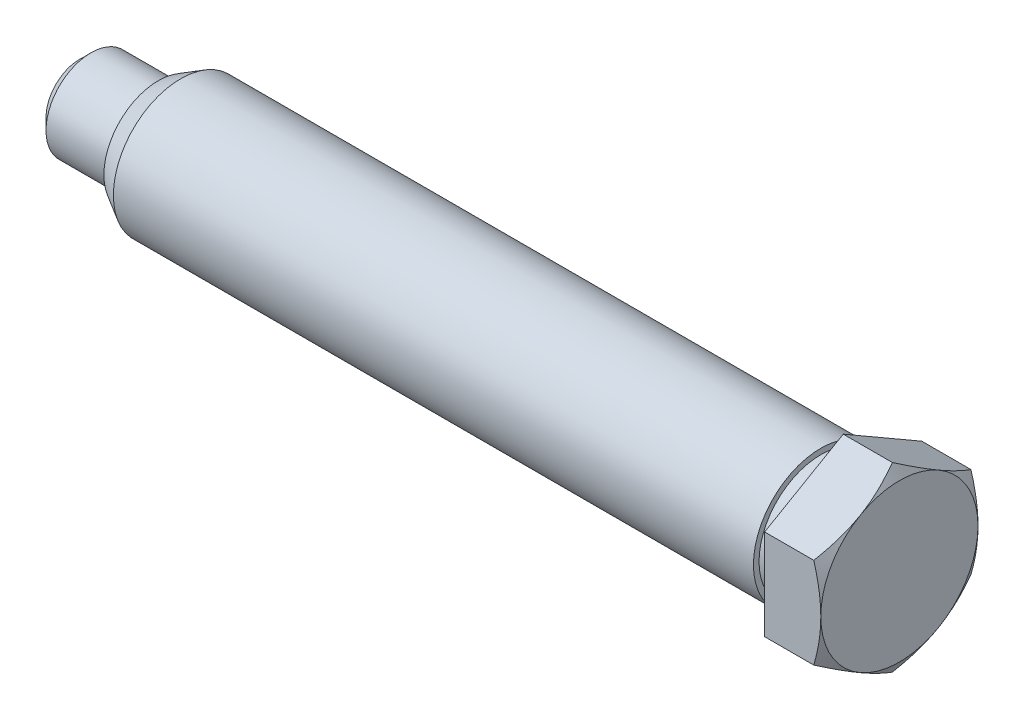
ISO-10303-21;
HEADER;
FILE_DESCRIPTION(('STEP AP214'),'2;1');
FILE_NAME('part.step','',(''),(''),'','','');
FILE_SCHEMA(('AUTOMOTIVE_DESIGN { 1 0 10303 214 1 1 1 1 }'));
ENDSEC;
DATA;
#1=APPLICATION_CONTEXT('core data for automotive mechanical design processes');
#2=APPLICATION_PROTOCOL_DEFINITION('international standard','automotive_design',2000,#1);
#3=PRODUCT_CONTEXT('',#1,'mechanical');
#4=PRODUCT('Part','Part','',(#3));
#5=PRODUCT_RELATED_PRODUCT_CATEGORY('part','',(#4));
#6=PRODUCT_DEFINITION_FORMATION('','',#4);
#7=PRODUCT_DEFINITION_CONTEXT('part definition',#1,'design');
#8=PRODUCT_DEFINITION('design','',#6,#7);
#9=PRODUCT_DEFINITION_SHAPE('','',#8);
#10=(LENGTH_UNIT() NAMED_UNIT(*) SI_UNIT(.MILLI.,.METRE.));
#11=(NAMED_UNIT(*) PLANE_ANGLE_UNIT() SI_UNIT($,.RADIAN.));
#12=(NAMED_UNIT(*) SI_UNIT($,.STERADIAN.) SOLID_ANGLE_UNIT());
#13=UNCERTAINTY_MEASURE_WITH_UNIT(LENGTH_MEASURE(1.E-05),#10,'distance_accuracy_value','');
#14=(GEOMETRIC_REPRESENTATION_CONTEXT(3) GLOBAL_UNCERTAINTY_ASSIGNED_CONTEXT((#13)) GLOBAL_UNIT_ASSIGNED_CONTEXT((#10,
#11,#12)) REPRESENTATION_CONTEXT('',''));
#15=CARTESIAN_POINT('',(0.,0.,0.));
#16=DIRECTION('',(0.,0.,1.));
#17=DIRECTION('',(1.,0.,0.));
#18=AXIS2_PLACEMENT_3D('',#15,#16,#17);
#19=CARTESIAN_POINT('',(-7.00000000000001,0.,0.));
#20=DIRECTION('',(-1.,0.,0.));
#21=DIRECTION('',(0.,0.,1.));
#22=AXIS2_PLACEMENT_3D('',#19,#20,#21);
#23=CONICAL_SURFACE('',#22,7.,1.04719755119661);
#24=CARTESIAN_POINT('',(-7.6252814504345,-4.04133641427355,-7.0002));
#25=CARTESIAN_POINT('',(-7.57399984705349,-4.13017208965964,-6.84633209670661));
#26=CARTESIAN_POINT('',(-7.52504559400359,-4.21933898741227,-6.69189049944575));
#27=CARTESIAN_POINT('',(-7.43243278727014,-4.3983969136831,-6.38175307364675));
#28=CARTESIAN_POINT('',(-7.38877651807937,-4.48828823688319,-6.22605673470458));
#29=CARTESIAN_POINT('',(-7.2666115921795,-4.7594014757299,-5.75647483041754));
#30=CARTESIAN_POINT('',(-7.19712555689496,-4.94169356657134,-5.4407356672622));
#31=CARTESIAN_POINT('',(-7.1156449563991,-5.21449036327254,-4.96823775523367));
#32=CARTESIAN_POINT('',(-7.09243348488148,-5.30417998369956,-4.81289077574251));
#33=CARTESIAN_POINT('',(-7.05351121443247,-5.48396448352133,-4.50149488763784));
#34=CARTESIAN_POINT('',(-7.03779975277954,-5.57405932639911,-4.34544604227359));
#35=CARTESIAN_POINT('',(-7.01427791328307,-5.75440548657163,-4.03307732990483));
#36=CARTESIAN_POINT('',(-7.00645856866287,-5.84465650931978,-3.87675797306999));
#37=CARTESIAN_POINT('',(-6.99888024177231,-6.02523694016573,-3.56398349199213));
#38=CARTESIAN_POINT('',(-6.99912101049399,-6.11556634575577,-3.40752837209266));
#39=CARTESIAN_POINT('',(-7.01085973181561,-6.36303901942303,-2.97889312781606));
#40=CARTESIAN_POINT('',(-7.03056574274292,-6.52010127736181,-2.7068533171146));
#41=CARTESIAN_POINT('',(-7.09305346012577,-6.83318259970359,-2.1645805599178));
#42=CARTESIAN_POINT('',(-7.13585652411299,-6.9892005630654,-1.89434952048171));
#43=CARTESIAN_POINT('',(-7.24285167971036,-7.30291195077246,-1.35098545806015));
#44=CARTESIAN_POINT('',(-7.30749709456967,-7.46056579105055,-1.07792099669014));
#45=CARTESIAN_POINT('',(-7.45421607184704,-7.77352241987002,-0.535864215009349));
#46=CARTESIAN_POINT('',(-7.53625517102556,-7.92882921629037,-0.266864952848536));
#47=CARTESIAN_POINT('',(-7.6252814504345,-8.08301923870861,0.000200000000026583));
#48=B_SPLINE_CURVE_WITH_KNOTS('',3,(#24,#25,#26,#27,#28,#29,#30,#31,#32,#33,#34,#35,#36,#37,#38,
#39,#40,#41,#42,#43,#44,#45,#46,#47),.UNSPECIFIED.,.F.,.F.,(4,2,2,2,2,2,2,2,2,2,2,4),(0.,
0.554727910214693,1.10969417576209,2.22193274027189,2.76443041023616,3.30688013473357,
3.84871284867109,4.39052882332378,5.33376515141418,6.27787517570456,7.24292418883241,
8.20607866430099),.UNSPECIFIED.);
#49=CARTESIAN_POINT('',(-7.62521478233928,-4.04145188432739,-7.));
#50=VERTEX_POINT('',#49);
#51=CARTESIAN_POINT('',(-7.,-6.06217782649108,-3.49999999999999));
#52=VERTEX_POINT('',#51);
#53=EDGE_CURVE('E189',#50,#52,#48,.T.);
#54=ORIENTED_EDGE('',*,*,#53,.F.);
#55=CARTESIAN_POINT('',(-12.0562612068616,-14.1175476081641,-7.));
#56=CARTESIAN_POINT('',(-11.878791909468,-13.7743985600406,-7.));
#57=CARTESIAN_POINT('',(-11.7022877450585,-13.4307456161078,-7.));
#58=CARTESIAN_POINT('',(-11.3517233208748,-12.7421707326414,-7.));
#59=CARTESIAN_POINT('',(-11.1776632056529,-12.397248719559,-7.));
#60=CARTESIAN_POINT('',(-10.8321439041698,-11.705158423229,-7.));
#61=CARTESIAN_POINT('',(-10.6606912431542,-11.3579868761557,-7.));
#62=CARTESIAN_POINT('',(-10.3215136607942,-10.6618336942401,-7.));
#63=CARTESIAN_POINT('',(-10.1537886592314,-10.3128520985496,-7.));
#64=CARTESIAN_POINT('',(-9.81363419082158,-9.59280463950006,-7.));
#65=CARTESIAN_POINT('',(-9.6414778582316,-9.22160934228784,-7.));
#66=CARTESIAN_POINT('',(-9.30391684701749,-8.47612168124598,-7.));
#67=CARTESIAN_POINT('',(-9.13851258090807,-8.10182912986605,-7.));
#68=CARTESIAN_POINT('',(-8.81672448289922,-7.34972432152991,-7.));
#69=CARTESIAN_POINT('',(-8.66033342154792,-6.97191517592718,-7.));
#70=CARTESIAN_POINT('',(-8.35940411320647,-6.21163259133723,-7.));
#71=CARTESIAN_POINT('',(-8.21486407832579,-5.8291598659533,-7.));
#72=CARTESIAN_POINT('',(-7.94328979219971,-5.06293805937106,-7.));
#73=CARTESIAN_POINT('',(-7.81607293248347,-4.6792545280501,-7.));
#74=CARTESIAN_POINT('',(-7.58253882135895,-3.90546502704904,-7.));
#75=CARTESIAN_POINT('',(-7.47622242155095,-3.51535879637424,-7.));
#76=CARTESIAN_POINT('',(-7.29304744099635,-2.73628130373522,-7.));
#77=CARTESIAN_POINT('',(-7.21564346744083,-2.34744267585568,-7.));
#78=CARTESIAN_POINT('',(-7.12441210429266,-1.76036363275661,-7.));
#79=CARTESIAN_POINT('',(-7.09814702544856,-1.56402816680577,-7.));
#80=CARTESIAN_POINT('',(-7.05458221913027,-1.17037366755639,-7.));
#81=CARTESIAN_POINT('',(-7.03728155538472,-0.973054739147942,-7.));
#82=CARTESIAN_POINT('',(-7.00927366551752,-0.532376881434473,-7.));
#83=CARTESIAN_POINT('',(-7.00099536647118,-0.288858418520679,-7.));
#84=CARTESIAN_POINT('',(-6.99917395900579,0.198238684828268,-7.));
#85=CARTESIAN_POINT('',(-7.00563138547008,0.441817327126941,-7.));
#86=CARTESIAN_POINT('',(-7.03297849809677,0.928201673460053,-7.));
#87=CARTESIAN_POINT('',(-7.05387107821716,1.17100721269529,-7.));
#88=CARTESIAN_POINT('',(-7.1091669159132,1.65506190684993,-7.));
#89=CARTESIAN_POINT('',(-7.14357063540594,1.89631100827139,-7.));
#90=CARTESIAN_POINT('',(-7.2256876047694,2.38354553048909,-7.));
#91=CARTESIAN_POINT('',(-7.27375043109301,2.62947140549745,-7.));
#92=CARTESIAN_POINT('',(-7.38106474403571,3.11884982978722,-7.));
#93=CARTESIAN_POINT('',(-7.44031652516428,3.3623023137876,-7.));
#94=CARTESIAN_POINT('',(-7.56837219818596,3.84680041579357,-7.));
#95=CARTESIAN_POINT('',(-7.63718116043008,4.08784468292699,-7.));
#96=CARTESIAN_POINT('',(-7.7828001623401,4.56747016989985,-7.));
#97=CARTESIAN_POINT('',(-7.8596097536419,4.80605152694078,-7.));
#98=CARTESIAN_POINT('',(-8.08438383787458,5.47209968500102,-7.));
#99=CARTESIAN_POINT('',(-8.23985795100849,5.89702916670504,-7.));
#100=CARTESIAN_POINT('',(-8.56634029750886,6.74091481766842,-7.));
#101=CARTESIAN_POINT('',(-8.73735291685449,7.159869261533,-7.));
#102=CARTESIAN_POINT('',(-9.0908103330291,7.99336644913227,-7.));
#103=CARTESIAN_POINT('',(-9.273265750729,8.40790466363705,-7.));
#104=CARTESIAN_POINT('',(-9.64648191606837,9.23315066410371,-7.));
#105=CARTESIAN_POINT('',(-9.83724178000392,9.64385885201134,-7.));
#106=CARTESIAN_POINT('',(-10.2256412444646,10.4635987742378,-7.));
#107=CARTESIAN_POINT('',(-10.4233007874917,10.8726210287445,-7.));
#108=CARTESIAN_POINT('',(-10.8234523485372,11.6882996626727,-7.));
#109=CARTESIAN_POINT('',(-11.0259444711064,12.0949559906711,-7.));
#110=CARTESIAN_POINT('',(-11.4345832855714,12.906151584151,-7.));
#111=CARTESIAN_POINT('',(-11.6407279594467,13.3106918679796,-7.));
#112=CARTESIAN_POINT('',(-12.0559997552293,14.1182324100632,-7.));
#113=CARTESIAN_POINT('',(-12.2651268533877,14.5212326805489,-7.));
#114=CARTESIAN_POINT('',(-12.8393126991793,15.619741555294,-7.));
#115=CARTESIAN_POINT('',(-13.2067496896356,16.3140064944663,-7.));
#116=CARTESIAN_POINT('',(-13.9467083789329,17.6999493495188,-7.));
#117=CARTESIAN_POINT('',(-14.3192308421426,18.391626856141,-7.));
#118=CARTESIAN_POINT('',(-15.0655016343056,19.7684289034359,-7.));
#119=CARTESIAN_POINT('',(-15.4392257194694,20.4535665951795,-7.));
#120=CARTESIAN_POINT('',(-16.0018406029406,21.4800820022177,-7.));
#121=CARTESIAN_POINT('',(-16.189700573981,21.8220255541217,-7.));
#122=CARTESIAN_POINT('',(-16.5660272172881,22.5055779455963,-7.));
#123=CARTESIAN_POINT('',(-16.7544938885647,22.8471867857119,-7.));
#124=CARTESIAN_POINT('',(-16.9432241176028,23.1886499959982,-7.));
#125=B_SPLINE_CURVE_WITH_KNOTS('',3,(#55,#56,#57,#58,#59,#60,#61,#62,#63,#64,#65,#66,#67,#68,
#69,#70,#71,#72,#73,#74,#75,#76,#77,#78,#79,#80,#81,#82,#83,#84,#85,#86,#87,#88,#89,#90,#91,#92,
#93,#94,#95,#96,#97,#98,#99,#100,#101,#102,#103,#104,#105,#106,#107,#108,#109,#110,#111,#112,
#113,#114,#115,#116,#117,#118,#119,#120,#121,#122,#123,#124),.UNSPECIFIED.,.F.,.F.,(4,2,2,2,2,2,
2,2,2,2,2,2,2,2,2,2,2,2,2,2,2,2,2,2,2,2,2,2,2,2,2,2,2,2,4),(0.,1.15897826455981,2.3180247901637,
3.4796076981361,4.64116558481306,5.86863732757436,7.09618395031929,8.32273185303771,
9.5490943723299,10.7613184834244,11.9735919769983,13.1616794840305,13.7557568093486,
14.3497720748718,15.0802978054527,15.8108500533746,16.5415488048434,17.2722725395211,
18.0237060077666,18.7751592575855,19.5270127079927,20.2788240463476,21.6357796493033,
22.9931194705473,24.3517383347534,25.7102129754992,27.073006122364,28.4358287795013,
29.7979206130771,31.1600016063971,33.5164749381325,35.8733064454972,38.2146112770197,
39.3850598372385,40.5555064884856),.UNSPECIFIED.);
#126=CARTESIAN_POINT('',(-7.,0.,-7.));
#127=VERTEX_POINT('',#126);
#128=EDGE_CURVE('E180',#127,#50,#125,.F.);
#129=ORIENTED_EDGE('',*,*,#128,.F.);
#130=CARTESIAN_POINT('',(-7.00000000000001,0.,0.));
#131=DIRECTION('',(-1.,0.,0.));
#132=DIRECTION('',(0.,0.,1.));
#133=AXIS2_PLACEMENT_3D('',#130,#131,#132);
#134=CIRCLE('',#133,7.);
#135=EDGE_CURVE('E134',#127,#52,#134,.T.);
#136=ORIENTED_EDGE('',*,*,#135,.T.);
#137=EDGE_LOOP('',(#54,#129,#136));
#138=FACE_BOUND('',#137,.T.);
#139=ADVANCED_FACE('F34',(#138),#23,.T.);
#140=CARTESIAN_POINT('',(-7.62521478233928,-8.08290376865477,0.));
#141=VERTEX_POINT('',#140);
#142=EDGE_CURVE('E133',#52,#141,#48,.T.);
#143=ORIENTED_EDGE('',*,*,#142,.F.);
#144=CARTESIAN_POINT('',(-7.,-6.06217782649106,3.50000000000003));
#145=VERTEX_POINT('',#144);
#146=EDGE_CURVE('E125',#52,#145,#134,.T.);
#147=ORIENTED_EDGE('',*,*,#146,.T.);
#148=CARTESIAN_POINT('',(-7.6252814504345,-8.08301923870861,-0.000199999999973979));
#149=CARTESIAN_POINT('',(-7.57399984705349,-7.99418356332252,0.153667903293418));
#150=CARTESIAN_POINT('',(-7.52504559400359,-7.90501666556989,0.308109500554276));
#151=CARTESIAN_POINT('',(-7.43243278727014,-7.72595873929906,0.618246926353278));
#152=CARTESIAN_POINT('',(-7.38877651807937,-7.63606741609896,0.773943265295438));
#153=CARTESIAN_POINT('',(-7.2666115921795,-7.36495417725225,1.24352516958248));
#154=CARTESIAN_POINT('',(-7.19712555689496,-7.18266208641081,1.55926433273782));
#155=CARTESIAN_POINT('',(-7.1156449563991,-6.9098652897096,2.03176224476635));
#156=CARTESIAN_POINT('',(-7.09243348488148,-6.82017566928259,2.1871092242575));
#157=CARTESIAN_POINT('',(-7.05351121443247,-6.64039116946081,2.49850511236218));
#158=CARTESIAN_POINT('',(-7.03779975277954,-6.55029632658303,2.65455395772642));
#159=CARTESIAN_POINT('',(-7.01427791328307,-6.36995016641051,2.96692267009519));
#160=CARTESIAN_POINT('',(-7.00645856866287,-6.27969914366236,3.12324202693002));
#161=CARTESIAN_POINT('',(-6.99888024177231,-6.09911871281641,3.43601650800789));
#162=CARTESIAN_POINT('',(-6.99912101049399,-6.00878930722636,3.59247162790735));
#163=CARTESIAN_POINT('',(-7.01085973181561,-5.7613166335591,4.02110687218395));
#164=CARTESIAN_POINT('',(-7.03056574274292,-5.60425437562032,4.29314668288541));
#165=CARTESIAN_POINT('',(-7.09305346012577,-5.29117305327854,4.8354194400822));
#166=CARTESIAN_POINT('',(-7.13585652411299,-5.13515508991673,5.10565047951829));
#167=CARTESIAN_POINT('',(-7.24285167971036,-4.82144370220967,5.64901454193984));
#168=CARTESIAN_POINT('',(-7.30749709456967,-4.66378986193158,5.92207900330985));
#169=CARTESIAN_POINT('',(-7.45421607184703,-4.35083323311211,6.46413578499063));
#170=CARTESIAN_POINT('',(-7.53625517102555,-4.19552643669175,6.73313504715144));
#171=CARTESIAN_POINT('',(-7.62528145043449,-4.04133641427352,7.0002));
#172=B_SPLINE_CURVE_WITH_KNOTS('',3,(#148,#149,#150,#151,#152,#153,#154,#155,#156,#157,#158,
#159,#160,#161,#162,#163,#164,#165,#166,#167,#168,#169,#170,#171),.UNSPECIFIED.,.F.,.F.,(4,2,2,
2,2,2,2,2,2,2,2,4),(0.,0.554727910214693,1.10969417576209,2.22193274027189,2.76443041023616,
3.30688013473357,3.84871284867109,4.39052882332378,5.33376515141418,6.27787517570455,
7.24292418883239,8.20607866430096),.UNSPECIFIED.);
#173=EDGE_CURVE('E105',#141,#145,#172,.T.);
#174=ORIENTED_EDGE('',*,*,#173,.F.);
#175=EDGE_LOOP('',(#143,#147,#174));
#176=FACE_BOUND('',#175,.T.);
#177=ADVANCED_FACE('F132',(#176),#23,.T.);
#178=CARTESIAN_POINT('',(-7.62521478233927,-4.04145188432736,7.));
#179=VERTEX_POINT('',#178);
#180=EDGE_CURVE('E57',#145,#179,#172,.T.);
#181=ORIENTED_EDGE('',*,*,#180,.F.);
#182=CARTESIAN_POINT('',(-7.,0.,7.));
#183=VERTEX_POINT('',#182);
#184=EDGE_CURVE('E117',#145,#183,#134,.T.);
#185=ORIENTED_EDGE('',*,*,#184,.T.);
#186=CARTESIAN_POINT('',(-12.0562612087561,-14.1175476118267,7.));
#187=CARTESIAN_POINT('',(-11.878791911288,-13.7743985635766,7.));
#188=CARTESIAN_POINT('',(-11.7022877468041,-13.4307456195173,7.));
#189=CARTESIAN_POINT('',(-11.3517233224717,-12.7421707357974,7.));
#190=CARTESIAN_POINT('',(-11.1776632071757,-12.3972487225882,7.));
#191=CARTESIAN_POINT('',(-10.8321439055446,-11.7051584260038,7.));
#192=CARTESIAN_POINT('',(-10.660691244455,-11.3579868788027,7.));
#193=CARTESIAN_POINT('',(-10.3215136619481,-10.6618336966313,7.));
#194=CARTESIAN_POINT('',(-10.1537886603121,-10.3128521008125,7.));
#195=CARTESIAN_POINT('',(-9.81363419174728,-9.59280464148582,7.));
#196=CARTESIAN_POINT('',(-9.64147785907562,-9.22160934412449,7.));
#197=CARTESIAN_POINT('',(-9.30391684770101,-8.47612168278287,7.));
#198=CARTESIAN_POINT('',(-9.13851258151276,-8.10182913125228,7.));
#199=CARTESIAN_POINT('',(-8.81672448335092,-7.34972432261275,7.));
#200=CARTESIAN_POINT('',(-8.66033342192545,-6.97191517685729,7.));
#201=CARTESIAN_POINT('',(-8.35940411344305,-6.21163259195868,7.));
#202=CARTESIAN_POINT('',(-8.2148640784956,-5.82915986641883,7.));
#203=CARTESIAN_POINT('',(-7.94328979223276,-5.06293805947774,7.));
#204=CARTESIAN_POINT('',(-7.81607293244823,-4.67925452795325,7.));
#205=CARTESIAN_POINT('',(-7.58253882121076,-3.9054650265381,7.));
#206=CARTESIAN_POINT('',(-7.4762224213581,-3.51535879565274,7.));
#207=CARTESIAN_POINT('',(-7.29304744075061,-2.73628130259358,7.));
#208=CARTESIAN_POINT('',(-7.2156434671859,-2.34744267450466,7.));
#209=CARTESIAN_POINT('',(-7.12441210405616,-1.76036363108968,7.));
#210=CARTESIAN_POINT('',(-7.09814702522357,-1.56402816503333,7.));
#211=CARTESIAN_POINT('',(-7.05458221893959,-1.170373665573,7.));
#212=CARTESIAN_POINT('',(-7.03728155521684,-0.973054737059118,7.));
#213=CARTESIAN_POINT('',(-7.00927366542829,-0.532376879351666,7.));
#214=CARTESIAN_POINT('',(-7.00099536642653,-0.288858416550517,7.));
#215=CARTESIAN_POINT('',(-6.99917395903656,0.198238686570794,7.));
#216=CARTESIAN_POINT('',(-7.0056313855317,0.441817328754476,7.));
#217=CARTESIAN_POINT('',(-7.03297849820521,0.928201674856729,7.));
#218=CARTESIAN_POINT('',(-7.05387107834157,1.1710072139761,7.));
#219=CARTESIAN_POINT('',(-7.10916691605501,1.65506190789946,7.));
#220=CARTESIAN_POINT('',(-7.14357063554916,1.8963110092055,7.));
#221=CARTESIAN_POINT('',(-7.22568760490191,2.3835455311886,7.));
#222=CARTESIAN_POINT('',(-7.27375043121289,2.62947140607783,7.));
#223=CARTESIAN_POINT('',(-7.38106474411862,3.11884983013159,7.));
#224=CARTESIAN_POINT('',(-7.44031652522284,3.3623023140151,7.));
#225=CARTESIAN_POINT('',(-7.56837219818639,3.84680041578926,7.));
#226=CARTESIAN_POINT('',(-7.63718116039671,4.08784468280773,7.));
#227=CARTESIAN_POINT('',(-7.78280016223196,4.567470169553,7.));
#228=CARTESIAN_POINT('',(-7.85960975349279,4.80605152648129,7.));
#229=CARTESIAN_POINT('',(-8.08438383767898,5.47209968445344,7.));
#230=CARTESIAN_POINT('',(-8.23985795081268,5.89702916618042,7.));
#231=CARTESIAN_POINT('',(-8.56634029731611,6.74091481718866,7.));
#232=CARTESIAN_POINT('',(-8.73735291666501,7.15986926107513,7.));
#233=CARTESIAN_POINT('',(-9.09081033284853,7.99336644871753,7.));
#234=CARTESIAN_POINT('',(-9.27326575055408,8.40790466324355,7.));
#235=CARTESIAN_POINT('',(-9.64648191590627,9.23315066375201,7.));
#236=CARTESIAN_POINT('',(-9.83724177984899,9.64385885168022,7.));
#237=CARTESIAN_POINT('',(-10.2256412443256,10.4635987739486,7.));
#238=CARTESIAN_POINT('',(-10.4233007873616,10.8726210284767,7.));
#239=CARTESIAN_POINT('',(-10.8234523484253,11.6882996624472,7.));
#240=CARTESIAN_POINT('',(-11.0259444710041,12.0949559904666,7.));
#241=CARTESIAN_POINT('',(-11.4345832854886,12.9061515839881,7.));
#242=CARTESIAN_POINT('',(-11.6407279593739,13.3106918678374,7.));
#243=CARTESIAN_POINT('',(-12.0559997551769,14.118232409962,7.));
#244=CARTESIAN_POINT('',(-12.2651268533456,14.5212326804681,7.));
#245=CARTESIAN_POINT('',(-12.8393126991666,15.6197415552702,7.));
#246=CARTESIAN_POINT('',(-13.2067496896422,16.3140064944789,7.));
#247=CARTESIAN_POINT('',(-13.9467083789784,17.6999493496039,7.));
#248=CARTESIAN_POINT('',(-14.319230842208,18.3916268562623,7.));
#249=CARTESIAN_POINT('',(-15.0655016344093,19.7684289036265,7.));
#250=CARTESIAN_POINT('',(-15.4392257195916,20.4535665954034,7.));
#251=CARTESIAN_POINT('',(-16.0018406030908,21.4800820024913,7.));
#252=CARTESIAN_POINT('',(-16.1897005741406,21.8220255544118,7.));
#253=CARTESIAN_POINT('',(-16.5660272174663,22.5055779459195,7.));
#254=CARTESIAN_POINT('',(-16.7544938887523,22.8471867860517,7.));
#255=CARTESIAN_POINT('',(-16.9432241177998,23.1886499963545,7.));
#256=B_SPLINE_CURVE_WITH_KNOTS('',3,(#186,#187,#188,#189,#190,#191,#192,#193,#194,#195,#196,
#197,#198,#199,#200,#201,#202,#203,#204,#205,#206,#207,#208,#209,#210,#211,#212,#213,#214,#215,
#216,#217,#218,#219,#220,#221,#222,#223,#224,#225,#226,#227,#228,#229,#230,#231,#232,#233,#234,
#235,#236,#237,#238,#239,#240,#241,#242,#243,#244,#245,#246,#247,#248,#249,#250,#251,#252,#253,
#254,#255),.UNSPECIFIED.,.F.,.F.,(4,2,2,2,2,2,2,2,2,2,2,2,2,2,2,2,2,2,2,2,2,2,2,2,2,2,2,2,2,2,2,
2,2,2,4),(0.,1.15897826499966,2.31802479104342,3.4796076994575,4.64116558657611,
5.86863732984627,7.09618395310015,8.32273185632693,9.54909437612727,10.7613184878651,
11.9735919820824,13.1616794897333,13.7557568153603,14.3497720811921,15.0802978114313,
15.8108500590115,16.5415488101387,17.2722725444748,18.0237060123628,18.7751592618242,
19.5270127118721,20.2788240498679,21.6357796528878,22.9931194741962,24.3517383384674,
25.7102129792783,27.0730061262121,28.4358287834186,29.7979206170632,31.160001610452,
33.5164749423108,35.873306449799,38.2146112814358,39.3850598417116,40.5555064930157),.UNSPECIFIED.);
#257=EDGE_CURVE('E119',#179,#183,#256,.T.);
#258=ORIENTED_EDGE('',*,*,#257,.F.);
#259=EDGE_LOOP('',(#181,#185,#258));
#260=FACE_BOUND('',#259,.T.);
#261=ADVANCED_FACE('F116',(#260),#23,.T.);
#262=CARTESIAN_POINT('',(-7.6252814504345,4.04133641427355,7.0002));
#263=CARTESIAN_POINT('',(-7.57399984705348,4.13017208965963,6.84633209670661));
#264=CARTESIAN_POINT('',(-7.52504559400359,4.21933898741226,6.69189049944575));
#265=CARTESIAN_POINT('',(-7.43243278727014,4.3983969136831,6.38175307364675));
#266=CARTESIAN_POINT('',(-7.38877651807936,4.48828823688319,6.22605673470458));
#267=CARTESIAN_POINT('',(-7.2666115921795,4.75940147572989,5.75647483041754));
#268=CARTESIAN_POINT('',(-7.19712555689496,4.94169356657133,5.4407356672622));
#269=CARTESIAN_POINT('',(-7.1156449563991,5.21449036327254,4.96823775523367));
#270=CARTESIAN_POINT('',(-7.09243348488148,5.30417998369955,4.81289077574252));
#271=CARTESIAN_POINT('',(-7.05351121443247,5.48396448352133,4.50149488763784));
#272=CARTESIAN_POINT('',(-7.03779975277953,5.57405932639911,4.34544604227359));
#273=CARTESIAN_POINT('',(-7.01427791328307,5.75440548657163,4.03307732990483));
#274=CARTESIAN_POINT('',(-7.00645856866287,5.84465650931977,3.87675797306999));
#275=CARTESIAN_POINT('',(-6.99888024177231,6.02523694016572,3.56398349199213));
#276=CARTESIAN_POINT('',(-6.99912101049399,6.11556634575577,3.40752837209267));
#277=CARTESIAN_POINT('',(-7.01085973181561,6.36303901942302,2.97889312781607));
#278=CARTESIAN_POINT('',(-7.03056574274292,6.52010127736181,2.7068533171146));
#279=CARTESIAN_POINT('',(-7.09305346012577,6.83318259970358,2.1645805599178));
#280=CARTESIAN_POINT('',(-7.13585652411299,6.9892005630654,1.89434952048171));
#281=CARTESIAN_POINT('',(-7.24285167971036,7.30291195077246,1.35098545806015));
#282=CARTESIAN_POINT('',(-7.30749709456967,7.46056579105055,1.07792099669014));
#283=CARTESIAN_POINT('',(-7.45421607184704,7.77352241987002,0.535864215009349));
#284=CARTESIAN_POINT('',(-7.53625517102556,7.92882921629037,0.266864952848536));
#285=CARTESIAN_POINT('',(-7.6252814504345,8.0830192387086,-0.000200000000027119));
#286=B_SPLINE_CURVE_WITH_KNOTS('',3,(#262,#263,#264,#265,#266,#267,#268,#269,#270,#271,#272,
#273,#274,#275,#276,#277,#278,#279,#280,#281,#282,#283,#284,#285),.UNSPECIFIED.,.F.,.F.,(4,2,2,
2,2,2,2,2,2,2,2,4),(0.,0.554727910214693,1.10969417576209,2.22193274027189,2.76443041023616,
3.30688013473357,3.84871284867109,4.39052882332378,5.33376515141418,6.27787517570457,
7.24292418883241,8.20607866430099),.UNSPECIFIED.);
#287=CARTESIAN_POINT('',(-7.62521478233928,4.04145188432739,7.));
#288=VERTEX_POINT('',#287);
#289=CARTESIAN_POINT('',(-7.,6.06217782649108,3.49999999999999));
#290=VERTEX_POINT('',#289);
#291=EDGE_CURVE('E220',#288,#290,#286,.T.);
#292=ORIENTED_EDGE('',*,*,#291,.F.);
#293=EDGE_CURVE('E179',#183,#288,#256,.T.);
#294=ORIENTED_EDGE('',*,*,#293,.F.);
#295=EDGE_CURVE('E129',#183,#290,#134,.T.);
#296=ORIENTED_EDGE('',*,*,#295,.T.);
#297=EDGE_LOOP('',(#292,#294,#296));
#298=FACE_BOUND('',#297,.T.);
#299=ADVANCED_FACE('F259',(#298),#23,.T.);
#300=CARTESIAN_POINT('',(-7.62521478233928,8.08290376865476,0.));
#301=VERTEX_POINT('',#300);
#302=EDGE_CURVE('E246',#290,#301,#286,.T.);
#303=ORIENTED_EDGE('',*,*,#302,.F.);
#304=CARTESIAN_POINT('',(-7.,6.06217782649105,-3.50000000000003));
#305=VERTEX_POINT('',#304);
#306=EDGE_CURVE('E136',#290,#305,#134,.T.);
#307=ORIENTED_EDGE('',*,*,#306,.T.);
#308=CARTESIAN_POINT('',(-7.6252814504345,8.0830192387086,0.00019999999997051));
#309=CARTESIAN_POINT('',(-7.57399984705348,7.99418356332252,-0.153667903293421));
#310=CARTESIAN_POINT('',(-7.52504559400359,7.90501666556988,-0.308109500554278));
#311=CARTESIAN_POINT('',(-7.43243278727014,7.72595873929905,-0.618246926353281));
#312=CARTESIAN_POINT('',(-7.38877651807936,7.63606741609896,-0.773943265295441));
#313=CARTESIAN_POINT('',(-7.2666115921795,7.36495417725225,-1.24352516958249));
#314=CARTESIAN_POINT('',(-7.19712555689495,7.18266208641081,-1.55926433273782));
#315=CARTESIAN_POINT('',(-7.1156449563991,6.9098652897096,-2.03176224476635));
#316=CARTESIAN_POINT('',(-7.09243348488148,6.82017566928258,-2.18710922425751));
#317=CARTESIAN_POINT('',(-7.05351121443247,6.6403911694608,-2.49850511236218));
#318=CARTESIAN_POINT('',(-7.03779975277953,6.55029632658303,-2.65455395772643));
#319=CARTESIAN_POINT('',(-7.01427791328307,6.3699501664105,-2.96692267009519));
#320=CARTESIAN_POINT('',(-7.00645856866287,6.27969914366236,-3.12324202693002));
#321=CARTESIAN_POINT('',(-6.99888024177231,6.09911871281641,-3.43601650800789));
#322=CARTESIAN_POINT('',(-6.99912101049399,6.00878930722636,-3.59247162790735));
#323=CARTESIAN_POINT('',(-7.01085973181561,5.7613166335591,-4.02110687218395));
#324=CARTESIAN_POINT('',(-7.03056574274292,5.60425437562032,-4.29314668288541));
#325=CARTESIAN_POINT('',(-7.09305346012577,5.29117305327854,-4.8354194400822));
#326=CARTESIAN_POINT('',(-7.13585652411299,5.13515508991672,-5.10565047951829));
#327=CARTESIAN_POINT('',(-7.24285167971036,4.82144370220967,-5.64901454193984));
#328=CARTESIAN_POINT('',(-7.30749709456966,4.66378986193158,-5.92207900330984));
#329=CARTESIAN_POINT('',(-7.45421607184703,4.35083323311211,-6.46413578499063));
#330=CARTESIAN_POINT('',(-7.53625517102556,4.19552643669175,-6.73313504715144));
#331=CARTESIAN_POINT('',(-7.62528145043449,4.04133641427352,-7.0002));
#332=B_SPLINE_CURVE_WITH_KNOTS('',3,(#308,#309,#310,#311,#312,#313,#314,#315,#316,#317,#318,
#319,#320,#321,#322,#323,#324,#325,#326,#327,#328,#329,#330,#331),.UNSPECIFIED.,.F.,.F.,(4,2,2,
2,2,2,2,2,2,2,2,4),(0.,0.554727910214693,1.10969417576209,2.22193274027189,2.76443041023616,
3.30688013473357,3.84871284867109,4.39052882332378,5.33376515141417,6.27787517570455,
7.24292418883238,8.20607866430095),.UNSPECIFIED.);
#333=EDGE_CURVE('E230',#301,#305,#332,.T.);
#334=ORIENTED_EDGE('',*,*,#333,.F.);
#335=EDGE_LOOP('',(#303,#307,#334));
#336=FACE_BOUND('',#335,.T.);
#337=ADVANCED_FACE('F250',(#336),#23,.T.);
#338=CARTESIAN_POINT('',(-7.62521478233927,4.04145188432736,-7.));
#339=VERTEX_POINT('',#338);
#340=EDGE_CURVE('E178',#305,#339,#332,.T.);
#341=ORIENTED_EDGE('',*,*,#340,.F.);
#342=EDGE_CURVE('E135',#305,#127,#134,.T.);
#343=ORIENTED_EDGE('',*,*,#342,.T.);
#344=EDGE_CURVE('E172',#339,#127,#125,.F.);
#345=ORIENTED_EDGE('',*,*,#344,.F.);
#346=EDGE_LOOP('',(#341,#343,#345));
#347=FACE_BOUND('',#346,.T.);
#348=ADVANCED_FACE('F177',(#347),#23,.T.);
#349=CARTESIAN_POINT('',(-12.,5.5,0.));
#350=DIRECTION('',(1.,0.,0.));
#351=DIRECTION('',(0.,0.,-1.));
#352=AXIS2_PLACEMENT_3D('',#349,#350,#351);
#353=PLANE('',#352);
#354=CARTESIAN_POINT('',(-12.,0.,0.));
#355=DIRECTION('',(-1.,0.,0.));
#356=DIRECTION('',(0.,0.,1.));
#357=AXIS2_PLACEMENT_3D('',#354,#355,#356);
#358=CIRCLE('',#357,5.5);
#359=CARTESIAN_POINT('',(-12.,0.,5.5));
#360=VERTEX_POINT('',#359);
#361=EDGE_CURVE('E130',#360,#360,#358,.T.);
#362=ORIENTED_EDGE('',*,*,#361,.F.);
#363=EDGE_LOOP('',(#362));
#364=FACE_BOUND('',#363,.T.);
#365=DIRECTION('',(0.,0.499999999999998,-0.86602540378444));
#366=VECTOR('',#365,1.);
#367=CARTESIAN_POINT('',(-12.,-4.68717782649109,-5.88156986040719));
#368=LINE('',#367,#366);
#369=CARTESIAN_POINT('',(-12.,-8.08290376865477,0.));
#370=VERTEX_POINT('',#369);
#371=CARTESIAN_POINT('',(-12.,-4.04145188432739,-7.));
#372=VERTEX_POINT('',#371);
#373=EDGE_CURVE('E232',#370,#372,#368,.T.);
#374=ORIENTED_EDGE('',*,*,#373,.F.);
#375=DIRECTION('',(0.,-0.500000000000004,-0.866025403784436));
#376=VECTOR('',#375,1.);
#377=CARTESIAN_POINT('',(-12.,-4.68717782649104,5.88156986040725));
#378=LINE('',#377,#376);
#379=CARTESIAN_POINT('',(-12.,-4.04145188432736,7.));
#380=VERTEX_POINT('',#379);
#381=EDGE_CURVE('E120',#380,#370,#378,.T.);
#382=ORIENTED_EDGE('',*,*,#381,.F.);
#383=DIRECTION('',(0.,-1.,0.));
#384=VECTOR('',#383,1.);
#385=CARTESIAN_POINT('',(-12.,5.5,7.));
#386=LINE('',#385,#384);
#387=CARTESIAN_POINT('',(-12.,4.04145188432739,7.));
#388=VERTEX_POINT('',#387);
#389=EDGE_CURVE('E162',#388,#380,#386,.T.);
#390=ORIENTED_EDGE('',*,*,#389,.F.);
#391=DIRECTION('',(0.,-0.499999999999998,0.86602540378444));
#392=VECTOR('',#391,1.);
#393=CARTESIAN_POINT('',(-12.,7.43717782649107,1.11843013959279));
#394=LINE('',#393,#392);
#395=CARTESIAN_POINT('',(-12.,8.08290376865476,0.));
#396=VERTEX_POINT('',#395);
#397=EDGE_CURVE('E49',#396,#388,#394,.T.);
#398=ORIENTED_EDGE('',*,*,#397,.F.);
#399=DIRECTION('',(0.,0.500000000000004,0.866025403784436));
#400=VECTOR('',#399,1.);
#401=CARTESIAN_POINT('',(-12.,7.43717782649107,-1.11843013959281));
#402=LINE('',#401,#400);
#403=CARTESIAN_POINT('',(-12.,4.04145188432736,-7.));
#404=VERTEX_POINT('',#403);
#405=EDGE_CURVE('E231',#404,#396,#402,.T.);
#406=ORIENTED_EDGE('',*,*,#405,.F.);
#407=DIRECTION('',(0.,1.,0.));
#408=VECTOR('',#407,1.);
#409=CARTESIAN_POINT('',(-12.,5.5,-7.));
#410=LINE('',#409,#408);
#411=EDGE_CURVE('E157',#372,#404,#410,.T.);
#412=ORIENTED_EDGE('',*,*,#411,.F.);
#413=EDGE_LOOP('',(#374,#382,#390,#398,#406,#412));
#414=FACE_BOUND('',#413,.T.);
#415=ADVANCED_FACE('F206',(#364,#414),#353,.F.);
#416=CARTESIAN_POINT('',(-80.,10.,-7.));
#417=DIRECTION('',(0.,0.,-1.));
#418=DIRECTION('',(0.,1.,0.));
#419=AXIS2_PLACEMENT_3D('',#416,#417,#418);
#420=PLANE('',#419);
#421=ORIENTED_EDGE('',*,*,#128,.T.);
#422=DIRECTION('',(-1.,0.,0.));
#423=VECTOR('',#422,1.);
#424=CARTESIAN_POINT('',(-80.,-4.04145188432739,-7.));
#425=LINE('',#424,#423);
#426=EDGE_CURVE('E11',#50,#372,#425,.T.);
#427=ORIENTED_EDGE('',*,*,#426,.T.);
#428=ORIENTED_EDGE('',*,*,#411,.T.);
#429=DIRECTION('',(1.,0.,0.));
#430=VECTOR('',#429,1.);
#431=CARTESIAN_POINT('',(-80.,4.04145188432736,-7.));
#432=LINE('',#431,#430);
#433=EDGE_CURVE('E42',#404,#339,#432,.T.);
#434=ORIENTED_EDGE('',*,*,#433,.T.);
#435=ORIENTED_EDGE('',*,*,#344,.T.);
#436=EDGE_LOOP('',(#421,#427,#428,#434,#435));
#437=FACE_BOUND('',#436,.T.);
#438=ADVANCED_FACE('F171',(#437),#420,.T.);
#439=CARTESIAN_POINT('',(-80.,10.,7.));
#440=DIRECTION('',(0.,0.,1.));
#441=DIRECTION('',(0.,-1.,0.));
#442=AXIS2_PLACEMENT_3D('',#439,#440,#441);
#443=PLANE('',#442);
#444=ORIENTED_EDGE('',*,*,#293,.T.);
#445=DIRECTION('',(-1.,0.,0.));
#446=VECTOR('',#445,1.);
#447=CARTESIAN_POINT('',(-80.,4.04145188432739,7.));
#448=LINE('',#447,#446);
#449=EDGE_CURVE('E167',#288,#388,#448,.T.);
#450=ORIENTED_EDGE('',*,*,#449,.T.);
#451=ORIENTED_EDGE('',*,*,#389,.T.);
#452=DIRECTION('',(1.,0.,0.));
#453=VECTOR('',#452,1.);
#454=CARTESIAN_POINT('',(-80.,-4.04145188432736,7.));
#455=LINE('',#454,#453);
#456=EDGE_CURVE('E165',#380,#179,#455,.T.);
#457=ORIENTED_EDGE('',*,*,#456,.T.);
#458=ORIENTED_EDGE('',*,*,#257,.T.);
#459=EDGE_LOOP('',(#444,#450,#451,#457,#458));
#460=FACE_BOUND('',#459,.T.);
#461=ADVANCED_FACE('F258',(#460),#443,.T.);
#462=CARTESIAN_POINT('',(-7.,7.,0.));
#463=DIRECTION('',(-1.,0.,0.));
#464=DIRECTION('',(0.,0.,1.));
#465=AXIS2_PLACEMENT_3D('',#462,#463,#464);
#466=PLANE('',#465);
#467=ORIENTED_EDGE('',*,*,#295,.F.);
#468=ORIENTED_EDGE('',*,*,#184,.F.);
#469=ORIENTED_EDGE('',*,*,#146,.F.);
#470=ORIENTED_EDGE('',*,*,#135,.F.);
#471=ORIENTED_EDGE('',*,*,#342,.F.);
#472=ORIENTED_EDGE('',*,*,#306,.F.);
#473=EDGE_LOOP('',(#467,#468,#469,#470,#471,#472));
#474=FACE_BOUND('',#473,.T.);
#475=ADVANCED_FACE('F36',(#474),#466,.F.);
#476=CARTESIAN_POINT('',(-100.,0.,0.));
#477=DIRECTION('',(-1.,0.,0.));
#478=DIRECTION('',(0.,0.,1.));
#479=AXIS2_PLACEMENT_3D('',#476,#477,#478);
#480=CYLINDRICAL_SURFACE('',#479,5.5);
#481=CARTESIAN_POINT('',(-14.,0.,0.));
#482=DIRECTION('',(-1.,0.,0.));
#483=DIRECTION('',(0.,0.,1.));
#484=AXIS2_PLACEMENT_3D('',#481,#482,#483);
#485=CIRCLE('',#484,5.5);
#486=CARTESIAN_POINT('',(-14.,0.,5.5));
#487=VERTEX_POINT('',#486);
#488=EDGE_CURVE('E436',#487,#487,#485,.T.);
#489=ORIENTED_EDGE('',*,*,#488,.F.);
#490=EDGE_LOOP('',(#489));
#491=FACE_BOUND('',#490,.T.);
#492=ORIENTED_EDGE('',*,*,#361,.T.);
#493=EDGE_LOOP('',(#492));
#494=FACE_BOUND('',#493,.T.);
#495=ADVANCED_FACE('F356',(#491,#494),#480,.T.);
#496=CARTESIAN_POINT('',(-14.,6.,0.));
#497=DIRECTION('',(-1.,0.,0.));
#498=DIRECTION('',(0.,0.,1.));
#499=AXIS2_PLACEMENT_3D('',#496,#497,#498);
#500=PLANE('',#499);
#501=CARTESIAN_POINT('',(-14.,0.,0.));
#502=DIRECTION('',(-1.,0.,0.));
#503=DIRECTION('',(0.,0.,1.));
#504=AXIS2_PLACEMENT_3D('',#501,#502,#503);
#505=CIRCLE('',#504,6.);
#506=CARTESIAN_POINT('',(-14.,0.,6.));
#507=VERTEX_POINT('',#506);
#508=EDGE_CURVE('E438',#507,#507,#505,.T.);
#509=ORIENTED_EDGE('',*,*,#508,.F.);
#510=EDGE_LOOP('',(#509));
#511=FACE_BOUND('',#510,.T.);
#512=ORIENTED_EDGE('',*,*,#488,.T.);
#513=EDGE_LOOP('',(#512));
#514=FACE_BOUND('',#513,.T.);
#515=ADVANCED_FACE('F349',(#511,#514),#500,.F.);
#516=CARTESIAN_POINT('',(-100.,0.,0.));
#517=DIRECTION('',(-1.,0.,0.));
#518=DIRECTION('',(0.,0.,1.));
#519=AXIS2_PLACEMENT_3D('',#516,#517,#518);
#520=CYLINDRICAL_SURFACE('',#519,6.);
#521=CARTESIAN_POINT('',(-71.,0.,0.));
#522=DIRECTION('',(-1.,0.,0.));
#523=DIRECTION('',(0.,0.,1.));
#524=AXIS2_PLACEMENT_3D('',#521,#522,#523);
#525=CIRCLE('',#524,6.);
#526=CARTESIAN_POINT('',(-71.,0.,6.));
#527=VERTEX_POINT('',#526);
#528=EDGE_CURVE('E443',#527,#527,#525,.T.);
#529=ORIENTED_EDGE('',*,*,#528,.F.);
#530=EDGE_LOOP('',(#529));
#531=FACE_BOUND('',#530,.T.);
#532=ORIENTED_EDGE('',*,*,#508,.T.);
#533=EDGE_LOOP('',(#532));
#534=FACE_BOUND('',#533,.T.);
#535=ADVANCED_FACE('F340',(#531,#534),#520,.T.);
#536=CARTESIAN_POINT('',(-71.,0.,0.));
#537=DIRECTION('',(1.,0.,0.));
#538=DIRECTION('',(0.,0.,-1.));
#539=AXIS2_PLACEMENT_3D('',#536,#537,#538);
#540=CONICAL_SURFACE('',#539,6.,0.5235987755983);
#541=CARTESIAN_POINT('',(-73.,0.,0.));
#542=DIRECTION('',(-1.,0.,0.));
#543=DIRECTION('',(0.,0.,1.));
#544=AXIS2_PLACEMENT_3D('',#541,#542,#543);
#545=CIRCLE('',#544,4.84529946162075);
#546=CARTESIAN_POINT('',(-73.,0.,4.84529946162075));
#547=VERTEX_POINT('',#546);
#548=EDGE_CURVE('E446',#547,#547,#545,.T.);
#549=ORIENTED_EDGE('',*,*,#548,.F.);
#550=EDGE_LOOP('',(#549));
#551=FACE_BOUND('',#550,.T.);
#552=ORIENTED_EDGE('',*,*,#528,.T.);
#553=EDGE_LOOP('',(#552));
#554=FACE_BOUND('',#553,.T.);
#555=ADVANCED_FACE('F332',(#551,#554),#540,.T.);
#556=CARTESIAN_POINT('',(-73.,4.,0.));
#557=DIRECTION('',(1.,0.,0.));
#558=DIRECTION('',(0.,0.,-1.));
#559=AXIS2_PLACEMENT_3D('',#556,#557,#558);
#560=PLANE('',#559);
#561=CARTESIAN_POINT('',(-73.,0.,0.));
#562=DIRECTION('',(-1.,0.,0.));
#563=DIRECTION('',(0.,0.,1.));
#564=AXIS2_PLACEMENT_3D('',#561,#562,#563);
#565=CIRCLE('',#564,4.);
#566=CARTESIAN_POINT('',(-73.,0.,4.));
#567=VERTEX_POINT('',#566);
#568=EDGE_CURVE('E448',#567,#567,#565,.T.);
#569=ORIENTED_EDGE('',*,*,#568,.F.);
#570=EDGE_LOOP('',(#569));
#571=FACE_BOUND('',#570,.T.);
#572=ORIENTED_EDGE('',*,*,#548,.T.);
#573=EDGE_LOOP('',(#572));
#574=FACE_BOUND('',#573,.T.);
#575=ADVANCED_FACE('F324',(#571,#574),#560,.F.);
#576=CARTESIAN_POINT('',(-100.,0.,0.));
#577=DIRECTION('',(-1.,0.,0.));
#578=DIRECTION('',(0.,0.,1.));
#579=AXIS2_PLACEMENT_3D('',#576,#577,#578);
#580=CYLINDRICAL_SURFACE('',#579,4.);
#581=CARTESIAN_POINT('',(-79.,0.,0.));
#582=DIRECTION('',(1.,0.,0.));
#583=DIRECTION('',(0.,0.,-1.));
#584=AXIS2_PLACEMENT_3D('',#581,#582,#583);
#585=CIRCLE('',#584,4.);
#586=CARTESIAN_POINT('',(-79.,0.,-4.));
#587=VERTEX_POINT('',#586);
#588=EDGE_CURVE('E153',#587,#587,#585,.T.);
#589=ORIENTED_EDGE('',*,*,#588,.T.);
#590=EDGE_LOOP('',(#589));
#591=FACE_BOUND('',#590,.T.);
#592=ORIENTED_EDGE('',*,*,#568,.T.);
#593=EDGE_LOOP('',(#592));
#594=FACE_BOUND('',#593,.T.);
#595=ADVANCED_FACE('F317',(#591,#594),#580,.T.);
#596=CARTESIAN_POINT('',(-80.,0.,0.));
#597=DIRECTION('',(1.,0.,0.));
#598=DIRECTION('',(0.,0.,-1.));
#599=AXIS2_PLACEMENT_3D('',#596,#597,#598);
#600=PLANE('',#599);
#601=CARTESIAN_POINT('',(-80.,0.,0.));
#602=DIRECTION('',(1.,0.,0.));
#603=DIRECTION('',(0.,0.,-1.));
#604=AXIS2_PLACEMENT_3D('',#601,#602,#603);
#605=CIRCLE('',#604,2.99999999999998);
#606=CARTESIAN_POINT('',(-80.,0.,-2.99999999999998));
#607=VERTEX_POINT('',#606);
#608=EDGE_CURVE('E148',#607,#607,#605,.F.);
#609=ORIENTED_EDGE('',*,*,#608,.T.);
#610=EDGE_LOOP('',(#609));
#611=FACE_BOUND('',#610,.T.);
#612=ADVANCED_FACE('F309',(#611),#600,.F.);
#613=CARTESIAN_POINT('',(-80.,0.,0.));
#614=DIRECTION('',(1.,0.,0.));
#615=DIRECTION('',(0.,0.,-1.));
#616=AXIS2_PLACEMENT_3D('',#613,#614,#615);
#617=CONICAL_SURFACE('',#616,2.99999999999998,0.785398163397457);
#618=ORIENTED_EDGE('',*,*,#588,.F.);
#619=EDGE_LOOP('',(#618));
#620=FACE_BOUND('',#619,.T.);
#621=ORIENTED_EDGE('',*,*,#608,.F.);
#622=EDGE_LOOP('',(#621));
#623=FACE_BOUND('',#622,.T.);
#624=ADVANCED_FACE('F287',(#620,#623),#617,.T.);
#625=CARTESIAN_POINT('',(-80.,-11.0621778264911,-5.16025403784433));
#626=DIRECTION('',(0.,-0.866025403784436,0.500000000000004));
#627=DIRECTION('',(0.,-0.500000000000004,-0.866025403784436));
#628=AXIS2_PLACEMENT_3D('',#625,#626,#627);
#629=PLANE('',#628);
#630=ORIENTED_EDGE('',*,*,#173,.T.);
#631=ORIENTED_EDGE('',*,*,#180,.T.);
#632=ORIENTED_EDGE('',*,*,#456,.F.);
#633=ORIENTED_EDGE('',*,*,#381,.T.);
#634=DIRECTION('',(-1.,0.,0.));
#635=VECTOR('',#634,1.);
#636=CARTESIAN_POINT('',(-80.,-8.08290376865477,0.));
#637=LINE('',#636,#635);
#638=EDGE_CURVE('E108',#141,#370,#637,.T.);
#639=ORIENTED_EDGE('',*,*,#638,.F.);
#640=EDGE_LOOP('',(#630,#631,#632,#633,#639));
#641=FACE_BOUND('',#640,.T.);
#642=ADVANCED_FACE('F106',(#641),#629,.T.);
#643=CARTESIAN_POINT('',(-80.,-1.0621778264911,-12.1602540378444));
#644=DIRECTION('',(0.,-0.86602540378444,-0.499999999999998));
#645=DIRECTION('',(0.,0.499999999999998,-0.86602540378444));
#646=AXIS2_PLACEMENT_3D('',#643,#644,#645);
#647=PLANE('',#646);
#648=ORIENTED_EDGE('',*,*,#142,.T.);
#649=ORIENTED_EDGE('',*,*,#638,.T.);
#650=ORIENTED_EDGE('',*,*,#373,.T.);
#651=ORIENTED_EDGE('',*,*,#426,.F.);
#652=ORIENTED_EDGE('',*,*,#53,.T.);
#653=EDGE_LOOP('',(#648,#649,#650,#651,#652));
#654=FACE_BOUND('',#653,.T.);
#655=ADVANCED_FACE('F237',(#654),#647,.T.);
#656=CARTESIAN_POINT('',(-80.,1.06217782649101,-12.1602540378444));
#657=DIRECTION('',(0.,0.866025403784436,-0.500000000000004));
#658=DIRECTION('',(0.,0.500000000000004,0.866025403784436));
#659=AXIS2_PLACEMENT_3D('',#656,#657,#658);
#660=PLANE('',#659);
#661=ORIENTED_EDGE('',*,*,#333,.T.);
#662=ORIENTED_EDGE('',*,*,#340,.T.);
#663=ORIENTED_EDGE('',*,*,#433,.F.);
#664=ORIENTED_EDGE('',*,*,#405,.T.);
#665=DIRECTION('',(-1.,0.,0.));
#666=VECTOR('',#665,1.);
#667=CARTESIAN_POINT('',(-80.,8.08290376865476,0.));
#668=LINE('',#667,#666);
#669=EDGE_CURVE('E248',#301,#396,#668,.T.);
#670=ORIENTED_EDGE('',*,*,#669,.F.);
#671=EDGE_LOOP('',(#661,#662,#663,#664,#670));
#672=FACE_BOUND('',#671,.T.);
#673=ADVANCED_FACE('F233',(#672),#660,.T.);
#674=CARTESIAN_POINT('',(-80.,11.0621778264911,-5.16025403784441));
#675=DIRECTION('',(0.,0.86602540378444,0.499999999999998));
#676=DIRECTION('',(0.,-0.499999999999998,0.86602540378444));
#677=AXIS2_PLACEMENT_3D('',#674,#675,#676);
#678=PLANE('',#677);
#679=ORIENTED_EDGE('',*,*,#302,.T.);
#680=ORIENTED_EDGE('',*,*,#669,.T.);
#681=ORIENTED_EDGE('',*,*,#397,.T.);
#682=ORIENTED_EDGE('',*,*,#449,.F.);
#683=ORIENTED_EDGE('',*,*,#291,.T.);
#684=EDGE_LOOP('',(#679,#680,#681,#682,#683));
#685=FACE_BOUND('',#684,.T.);
#686=ADVANCED_FACE('F236',(#685),#678,.T.);
#687=CLOSED_SHELL('',(#139,#177,#261,#299,#337,#348,#415,#438,#461,#475,#495,#515,#535,#555,
#575,#595,#612,#624,#642,#655,#673,#686));
#688=MANIFOLD_SOLID_BREP('B2',#687);
#689=ADVANCED_BREP_SHAPE_REPRESENTATION('',(#18,#688),#14);
#690=SHAPE_DEFINITION_REPRESENTATION(#9,#689);
ENDSEC;
END-ISO-10303-21;
